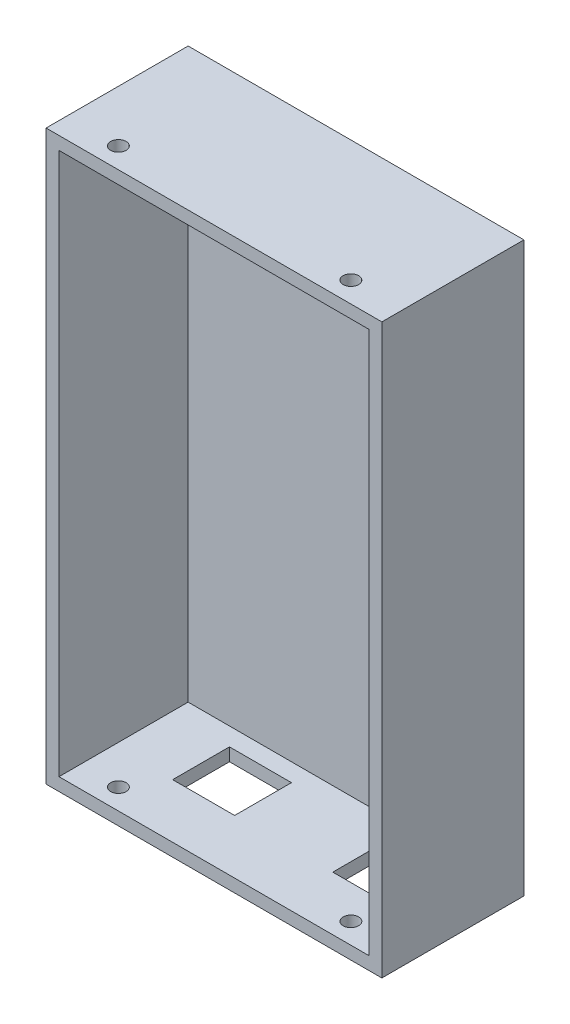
from build123d import *

# Parameters (mm, degrees)
SKETCH2_W           = 65
SKETCH2_H           = 110
BOSS_EXTRUDE1_DEPTH = 2.5
SKETCH3_W           = 65
SKETCH3_H           = 110
SKETCH3_W_2         = 60
SKETCH3_H_2         = 105
BOSS_EXTRUDE2_DEPTH = 25
SKETCH4_W           = 12
SKETCH4_H           = 11
SKETCH4_W_2         = 9.5
CUT_EXTRUDE3_DEPTH  = 17
SKETCH5_R           = 1.5
CUT_EXTRUDE4_DEPTH  = 118.951261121


with BuildPart() as part:
    # Sketch2 → Boss-Extrude1 (new body)
    with BuildSketch(Plane.XY):
        Rectangle(SKETCH2_W, SKETCH2_H)
    extrude(amount=BOSS_EXTRUDE1_DEPTH)

    # Sketch3 → Boss-Extrude2 (add)
    with BuildSketch(Plane.XY.offset(2.5)):
        Rectangle(SKETCH3_W, SKETCH3_H)
        Rectangle(SKETCH3_W_2, SKETCH3_H_2, mode=Mode.SUBTRACT)
    extrude(amount=BOSS_EXTRUDE2_DEPTH)

    # Sketch4 → Cut-Extrude3 (cut)
    with BuildSketch(Plane.XZ.offset(55)):
        with Locations((-12.5, 11.5)):
            Rectangle(SKETCH4_W, SKETCH4_H)
        with Locations((17.25, 11.5)):
            Rectangle(SKETCH4_W_2, SKETCH4_H)
    extrude(amount=-CUT_EXTRUDE3_DEPTH, mode=Mode.SUBTRACT)

    # Sketch5 → Cut-Extrude4 (cut, through all)
    with BuildSketch(Plane(origin=(0, -55, 0), x_dir=(-1, 0, 0), z_dir=(0, -1, 0))):
        with Locations(Location((22.5, -23.5, 0), (0, 0, 90))):
            Circle(SKETCH5_R)
        with Locations(Location((-22.5, -23.5, 0), (0, 0, 90))):
            Circle(SKETCH5_R)
    extrude(amount=-CUT_EXTRUDE4_DEPTH, mode=Mode.SUBTRACT)


solid = part.part
